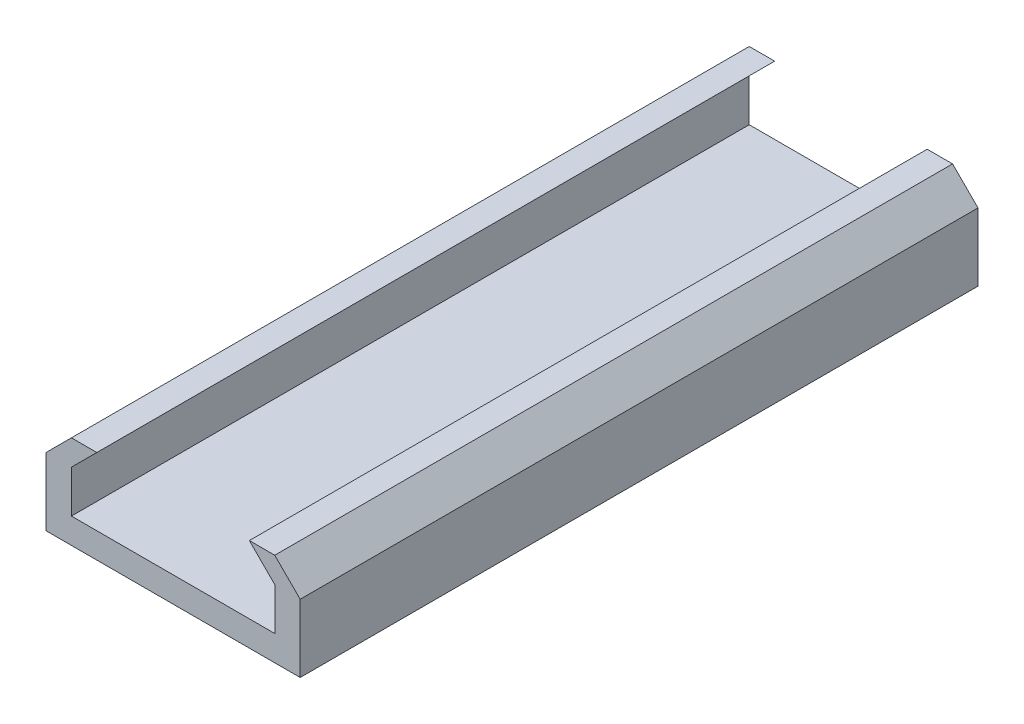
from build123d import *

# Parameters (mm, degrees)
BASE_EXTRUDE_DEPTH = 254


with BuildPart() as part:
    # Sketch1 → Base-Extrude (new body)
    with BuildSketch(Plane.XY):
        Polygon((-47.625, 15.875), (-38.1, 25.4), (-28.575, 25.4), (-38.1, 15.875), (-38.1, 0), (38.1, 0), (38.1, 15.875), (28.575, 25.4), (38.1, 25.4), (47.625, 15.875), (47.625, -9.525), (-47.625, -9.525), align=None)
    extrude(amount=-BASE_EXTRUDE_DEPTH)


solid = part.part
